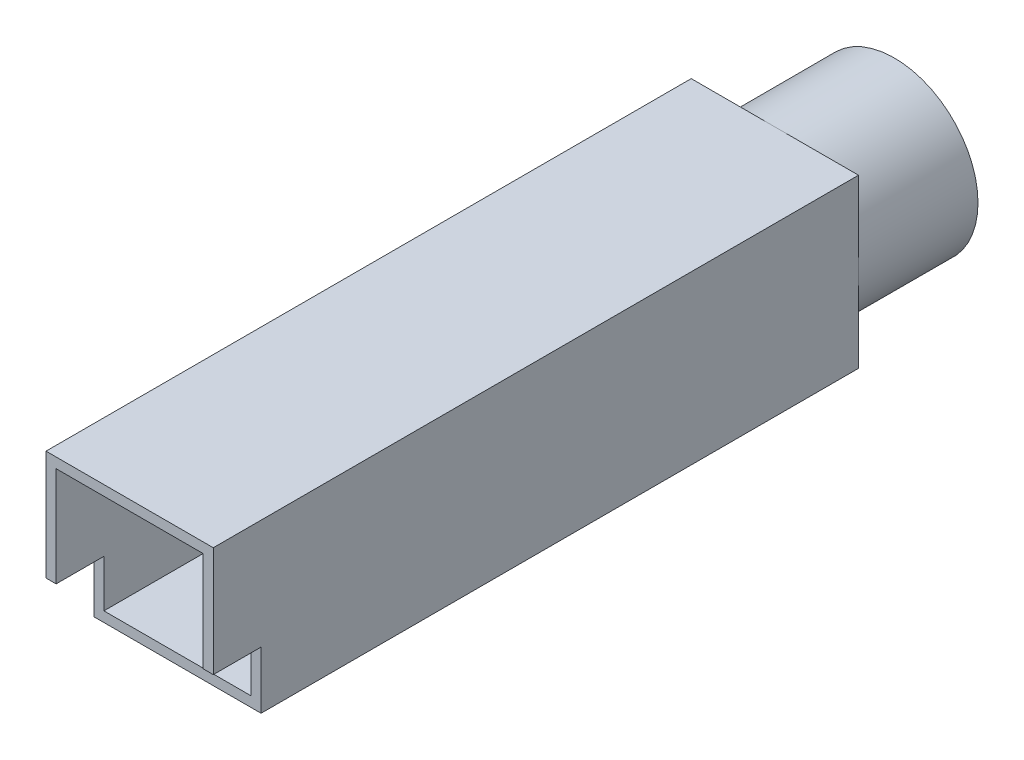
ISO-10303-21;
HEADER;
FILE_DESCRIPTION(('STEP AP214'),'2;1');
FILE_NAME('part.step','',(''),(''),'','','');
FILE_SCHEMA(('AUTOMOTIVE_DESIGN { 1 0 10303 214 1 1 1 1 }'));
ENDSEC;
DATA;
#1=APPLICATION_CONTEXT('core data for automotive mechanical design processes');
#2=APPLICATION_PROTOCOL_DEFINITION('international standard','automotive_design',2000,#1);
#3=PRODUCT_CONTEXT('',#1,'mechanical');
#4=PRODUCT('Part','Part','',(#3));
#5=PRODUCT_RELATED_PRODUCT_CATEGORY('part','',(#4));
#6=PRODUCT_DEFINITION_FORMATION('','',#4);
#7=PRODUCT_DEFINITION_CONTEXT('part definition',#1,'design');
#8=PRODUCT_DEFINITION('design','',#6,#7);
#9=PRODUCT_DEFINITION_SHAPE('','',#8);
#10=(LENGTH_UNIT() NAMED_UNIT(*) SI_UNIT(.MILLI.,.METRE.));
#11=(NAMED_UNIT(*) PLANE_ANGLE_UNIT() SI_UNIT($,.RADIAN.));
#12=(NAMED_UNIT(*) SI_UNIT($,.STERADIAN.) SOLID_ANGLE_UNIT());
#13=UNCERTAINTY_MEASURE_WITH_UNIT(LENGTH_MEASURE(1.E-05),#10,'distance_accuracy_value','');
#14=(GEOMETRIC_REPRESENTATION_CONTEXT(3) GLOBAL_UNCERTAINTY_ASSIGNED_CONTEXT((#13)) GLOBAL_UNIT_ASSIGNED_CONTEXT((#10,
#11,#12)) REPRESENTATION_CONTEXT('',''));
#15=CARTESIAN_POINT('',(0.,0.,0.));
#16=DIRECTION('',(0.,0.,1.));
#17=DIRECTION('',(1.,0.,0.));
#18=AXIS2_PLACEMENT_3D('',#15,#16,#17);
#19=CARTESIAN_POINT('',(15.3825358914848,-15.3825358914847,160.));
#20=DIRECTION('',(-1.,0.,0.));
#21=DIRECTION('',(0.,0.,1.));
#22=AXIS2_PLACEMENT_3D('',#19,#20,#21);
#23=PLANE('',#22);
#24=DIRECTION('',(0.,-1.,0.));
#25=VECTOR('',#24,1.);
#26=CARTESIAN_POINT('',(15.3825358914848,-15.3825358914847,150.));
#27=LINE('',#26,#25);
#28=CARTESIAN_POINT('',(15.3825358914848,-5.5,150.));
#29=VERTEX_POINT('',#28);
#30=CARTESIAN_POINT('',(15.3825358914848,-15.3825358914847,150.));
#31=VERTEX_POINT('',#30);
#32=EDGE_CURVE('E499',#29,#31,#27,.T.);
#33=ORIENTED_EDGE('',*,*,#32,.F.);
#34=DIRECTION('',(0.,0.,-1.));
#35=VECTOR('',#34,1.);
#36=CARTESIAN_POINT('',(15.3825358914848,-5.5,160.));
#37=LINE('',#36,#35);
#38=CARTESIAN_POINT('',(15.3825358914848,-5.5,160.));
#39=VERTEX_POINT('',#38);
#40=EDGE_CURVE('E503',#39,#29,#37,.T.);
#41=ORIENTED_EDGE('',*,*,#40,.F.);
#42=DIRECTION('',(0.,1.,0.));
#43=VECTOR('',#42,1.);
#44=CARTESIAN_POINT('',(15.3825358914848,-15.3825358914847,160.));
#45=LINE('',#44,#43);
#46=CARTESIAN_POINT('',(15.3825358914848,15.3825358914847,160.));
#47=VERTEX_POINT('',#46);
#48=EDGE_CURVE('E188',#39,#47,#45,.T.);
#49=ORIENTED_EDGE('',*,*,#48,.T.);
#50=DIRECTION('',(0.,0.,-1.));
#51=VECTOR('',#50,1.);
#52=CARTESIAN_POINT('',(15.3825358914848,15.3825358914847,160.));
#53=LINE('',#52,#51);
#54=CARTESIAN_POINT('',(15.3825358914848,15.3825358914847,26.));
#55=VERTEX_POINT('',#54);
#56=EDGE_CURVE('E204',#47,#55,#53,.T.);
#57=ORIENTED_EDGE('',*,*,#56,.T.);
#58=DIRECTION('',(0.,1.,0.));
#59=VECTOR('',#58,1.);
#60=CARTESIAN_POINT('',(15.3825358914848,-15.3825358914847,26.));
#61=LINE('',#60,#59);
#62=CARTESIAN_POINT('',(15.3825358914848,-15.3825358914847,26.));
#63=VERTEX_POINT('',#62);
#64=EDGE_CURVE('E536',#63,#55,#61,.T.);
#65=ORIENTED_EDGE('',*,*,#64,.F.);
#66=DIRECTION('',(0.,0.,-1.));
#67=VECTOR('',#66,1.);
#68=CARTESIAN_POINT('',(15.3825358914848,-15.3825358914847,160.));
#69=LINE('',#68,#67);
#70=EDGE_CURVE('E551',#31,#63,#69,.T.);
#71=ORIENTED_EDGE('',*,*,#70,.F.);
#72=EDGE_LOOP('',(#33,#41,#49,#57,#65,#71));
#73=FACE_BOUND('',#72,.T.);
#74=ADVANCED_FACE('F39',(#73),#23,.T.);
#75=CARTESIAN_POINT('',(-15.3825358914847,15.3825358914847,160.));
#76=DIRECTION('',(0.,-1.,0.));
#77=DIRECTION('',(0.,0.,-1.));
#78=AXIS2_PLACEMENT_3D('',#75,#76,#77);
#79=PLANE('',#78);
#80=DIRECTION('',(0.,0.,-1.));
#81=VECTOR('',#80,1.);
#82=CARTESIAN_POINT('',(-15.3825358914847,15.3825358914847,160.));
#83=LINE('',#82,#81);
#84=CARTESIAN_POINT('',(-15.3825358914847,15.3825358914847,160.));
#85=VERTEX_POINT('',#84);
#86=CARTESIAN_POINT('',(-15.3825358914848,15.3825358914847,26.));
#87=VERTEX_POINT('',#86);
#88=EDGE_CURVE('E553',#85,#87,#83,.T.);
#89=ORIENTED_EDGE('',*,*,#88,.T.);
#90=DIRECTION('',(-1.,0.,0.));
#91=VECTOR('',#90,1.);
#92=CARTESIAN_POINT('',(-15.3825358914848,15.3825358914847,26.));
#93=LINE('',#92,#91);
#94=EDGE_CURVE('E538',#55,#87,#93,.T.);
#95=ORIENTED_EDGE('',*,*,#94,.F.);
#96=ORIENTED_EDGE('',*,*,#56,.F.);
#97=DIRECTION('',(-1.,0.,0.));
#98=VECTOR('',#97,1.);
#99=CARTESIAN_POINT('',(-15.3825358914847,15.3825358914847,160.));
#100=LINE('',#99,#98);
#101=EDGE_CURVE('E546',#47,#85,#100,.T.);
#102=ORIENTED_EDGE('',*,*,#101,.T.);
#103=EDGE_LOOP('',(#89,#95,#96,#102));
#104=FACE_BOUND('',#103,.T.);
#105=ADVANCED_FACE('F253',(#104),#79,.T.);
#106=CARTESIAN_POINT('',(-15.3825358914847,-15.3825358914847,160.));
#107=DIRECTION('',(1.,0.,0.));
#108=DIRECTION('',(0.,0.,-1.));
#109=AXIS2_PLACEMENT_3D('',#106,#107,#108);
#110=PLANE('',#109);
#111=DIRECTION('',(0.,1.,0.));
#112=VECTOR('',#111,1.);
#113=CARTESIAN_POINT('',(-15.3825358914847,-15.3825358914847,150.));
#114=LINE('',#113,#112);
#115=CARTESIAN_POINT('',(-15.3825358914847,-15.3825358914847,150.));
#116=VERTEX_POINT('',#115);
#117=CARTESIAN_POINT('',(-15.3825358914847,-5.5,150.));
#118=VERTEX_POINT('',#117);
#119=EDGE_CURVE('E497',#116,#118,#114,.T.);
#120=ORIENTED_EDGE('',*,*,#119,.F.);
#121=DIRECTION('',(0.,0.,-1.));
#122=VECTOR('',#121,1.);
#123=CARTESIAN_POINT('',(-15.3825358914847,-15.3825358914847,160.));
#124=LINE('',#123,#122);
#125=CARTESIAN_POINT('',(-15.3825358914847,-15.3825358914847,26.));
#126=VERTEX_POINT('',#125);
#127=EDGE_CURVE('E64',#116,#126,#124,.T.);
#128=ORIENTED_EDGE('',*,*,#127,.T.);
#129=DIRECTION('',(0.,-1.,0.));
#130=VECTOR('',#129,1.);
#131=CARTESIAN_POINT('',(-15.3825358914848,-15.3825358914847,26.));
#132=LINE('',#131,#130);
#133=EDGE_CURVE('E540',#87,#126,#132,.T.);
#134=ORIENTED_EDGE('',*,*,#133,.F.);
#135=ORIENTED_EDGE('',*,*,#88,.F.);
#136=DIRECTION('',(0.,-1.,0.));
#137=VECTOR('',#136,1.);
#138=CARTESIAN_POINT('',(-15.3825358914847,-15.3825358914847,160.));
#139=LINE('',#138,#137);
#140=CARTESIAN_POINT('',(-15.3825358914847,-5.5,160.));
#141=VERTEX_POINT('',#140);
#142=EDGE_CURVE('E548',#85,#141,#139,.T.);
#143=ORIENTED_EDGE('',*,*,#142,.T.);
#144=DIRECTION('',(0.,0.,1.));
#145=VECTOR('',#144,1.);
#146=CARTESIAN_POINT('',(-15.3825358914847,-5.5,160.));
#147=LINE('',#146,#145);
#148=EDGE_CURVE('E501',#118,#141,#147,.T.);
#149=ORIENTED_EDGE('',*,*,#148,.F.);
#150=EDGE_LOOP('',(#120,#128,#134,#135,#143,#149));
#151=FACE_BOUND('',#150,.T.);
#152=ADVANCED_FACE('F261',(#151),#110,.T.);
#153=CARTESIAN_POINT('',(-15.3825358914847,-15.3825358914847,160.));
#154=DIRECTION('',(0.,1.,0.));
#155=DIRECTION('',(0.,0.,1.));
#156=AXIS2_PLACEMENT_3D('',#153,#154,#155);
#157=PLANE('',#156);
#158=DIRECTION('',(-1.,0.,0.));
#159=VECTOR('',#158,1.);
#160=CARTESIAN_POINT('',(-15.3825358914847,-15.3825358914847,150.));
#161=LINE('',#160,#159);
#162=EDGE_CURVE('E490',#31,#116,#161,.T.);
#163=ORIENTED_EDGE('',*,*,#162,.F.);
#164=ORIENTED_EDGE('',*,*,#70,.T.);
#165=DIRECTION('',(1.,0.,0.));
#166=VECTOR('',#165,1.);
#167=CARTESIAN_POINT('',(-15.3825358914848,-15.3825358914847,26.));
#168=LINE('',#167,#166);
#169=EDGE_CURVE('E542',#126,#63,#168,.T.);
#170=ORIENTED_EDGE('',*,*,#169,.F.);
#171=ORIENTED_EDGE('',*,*,#127,.F.);
#172=EDGE_LOOP('',(#163,#164,#170,#171));
#173=FACE_BOUND('',#172,.T.);
#174=ADVANCED_FACE('F391',(#173),#157,.T.);
#175=CARTESIAN_POINT('',(0.,0.,0.));
#176=DIRECTION('',(0.,0.,1.));
#177=DIRECTION('',(1.,0.,0.));
#178=AXIS2_PLACEMENT_3D('',#175,#176,#177);
#179=PLANE('',#178);
#180=CARTESIAN_POINT('',(0.,0.,0.));
#181=DIRECTION('',(0.,0.,1.));
#182=DIRECTION('',(1.,0.,0.));
#183=AXIS2_PLACEMENT_3D('',#180,#181,#182);
#184=CIRCLE('',#183,17.5);
#185=CARTESIAN_POINT('',(17.5,0.,0.));
#186=VERTEX_POINT('',#185);
#187=EDGE_CURVE('E43',#186,#186,#184,.T.);
#188=ORIENTED_EDGE('',*,*,#187,.F.);
#189=EDGE_LOOP('',(#188));
#190=FACE_BOUND('',#189,.T.);
#191=CARTESIAN_POINT('',(0.,0.,0.));
#192=DIRECTION('',(0.,0.,1.));
#193=DIRECTION('',(1.,0.,0.));
#194=AXIS2_PLACEMENT_3D('',#191,#192,#193);
#195=CIRCLE('',#194,16.);
#196=CARTESIAN_POINT('',(16.,0.,0.));
#197=VERTEX_POINT('',#196);
#198=EDGE_CURVE('E228',#197,#197,#195,.T.);
#199=ORIENTED_EDGE('',*,*,#198,.T.);
#200=EDGE_LOOP('',(#199));
#201=FACE_BOUND('',#200,.T.);
#202=ADVANCED_FACE('F235',(#190,#201),#179,.F.);
#203=CARTESIAN_POINT('',(0.,0.,25.));
#204=DIRECTION('',(0.,0.,-1.));
#205=DIRECTION('',(-1.,0.,0.));
#206=AXIS2_PLACEMENT_3D('',#203,#204,#205);
#207=CYLINDRICAL_SURFACE('',#206,17.5);
#208=CARTESIAN_POINT('',(0.,0.,25.));
#209=DIRECTION('',(0.,0.,1.));
#210=DIRECTION('',(1.,0.,0.));
#211=AXIS2_PLACEMENT_3D('',#208,#209,#210);
#212=CIRCLE('',#211,17.5);
#213=CARTESIAN_POINT('',(17.5,0.,25.));
#214=VERTEX_POINT('',#213);
#215=CARTESIAN_POINT('',(0.,17.5,25.));
#216=VERTEX_POINT('',#215);
#217=EDGE_CURVE('E11',#214,#216,#212,.T.);
#218=ORIENTED_EDGE('',*,*,#217,.F.);
#219=CARTESIAN_POINT('',(0.,-17.5,25.));
#220=VERTEX_POINT('',#219);
#221=EDGE_CURVE('E49',#220,#214,#212,.T.);
#222=ORIENTED_EDGE('',*,*,#221,.F.);
#223=CARTESIAN_POINT('',(-17.5,0.,25.));
#224=VERTEX_POINT('',#223);
#225=EDGE_CURVE('E467',#224,#220,#212,.T.);
#226=ORIENTED_EDGE('',*,*,#225,.F.);
#227=EDGE_CURVE('E48',#216,#224,#212,.T.);
#228=ORIENTED_EDGE('',*,*,#227,.F.);
#229=EDGE_LOOP('',(#218,#222,#226,#228));
#230=FACE_BOUND('',#229,.T.);
#231=ORIENTED_EDGE('',*,*,#187,.T.);
#232=EDGE_LOOP('',(#231));
#233=FACE_BOUND('',#232,.T.);
#234=ADVANCED_FACE('F41',(#230,#233),#207,.T.);
#235=CARTESIAN_POINT('',(0.,0.,25.));
#236=DIRECTION('',(0.,0.,-1.));
#237=DIRECTION('',(-1.,0.,0.));
#238=AXIS2_PLACEMENT_3D('',#235,#236,#237);
#239=CYLINDRICAL_SURFACE('',#238,16.);
#240=CARTESIAN_POINT('',(0.,0.,25.));
#241=DIRECTION('',(0.,0.,1.));
#242=DIRECTION('',(1.,0.,0.));
#243=AXIS2_PLACEMENT_3D('',#240,#241,#242);
#244=CIRCLE('',#243,16.);
#245=CARTESIAN_POINT('',(16.,0.,25.));
#246=VERTEX_POINT('',#245);
#247=EDGE_CURVE('E229',#246,#246,#244,.T.);
#248=ORIENTED_EDGE('',*,*,#247,.T.);
#249=EDGE_LOOP('',(#248));
#250=FACE_BOUND('',#249,.T.);
#251=ORIENTED_EDGE('',*,*,#198,.F.);
#252=EDGE_LOOP('',(#251));
#253=FACE_BOUND('',#252,.T.);
#254=ADVANCED_FACE('F237',(#250,#253),#239,.F.);
#255=CARTESIAN_POINT('',(0.,0.,25.));
#256=DIRECTION('',(0.,0.,-1.));
#257=DIRECTION('',(-1.,0.,0.));
#258=AXIS2_PLACEMENT_3D('',#255,#256,#257);
#259=PLANE('',#258);
#260=ORIENTED_EDGE('',*,*,#217,.T.);
#261=DIRECTION('',(-1.,0.,0.));
#262=VECTOR('',#261,1.);
#263=CARTESIAN_POINT('',(-17.5,17.5,25.));
#264=LINE('',#263,#262);
#265=CARTESIAN_POINT('',(17.5,17.5,25.));
#266=VERTEX_POINT('',#265);
#267=EDGE_CURVE('E214',#266,#216,#264,.T.);
#268=ORIENTED_EDGE('',*,*,#267,.F.);
#269=DIRECTION('',(0.,1.,0.));
#270=VECTOR('',#269,1.);
#271=CARTESIAN_POINT('',(17.5,-17.5,25.));
#272=LINE('',#271,#270);
#273=EDGE_CURVE('E213',#214,#266,#272,.T.);
#274=ORIENTED_EDGE('',*,*,#273,.F.);
#275=EDGE_LOOP('',(#260,#268,#274));
#276=FACE_BOUND('',#275,.T.);
#277=ADVANCED_FACE('F239',(#276),#259,.T.);
#278=CARTESIAN_POINT('',(-17.5,17.5,25.));
#279=VERTEX_POINT('',#278);
#280=EDGE_CURVE('E212',#216,#279,#264,.T.);
#281=ORIENTED_EDGE('',*,*,#280,.F.);
#282=ORIENTED_EDGE('',*,*,#227,.T.);
#283=DIRECTION('',(0.,-1.,0.));
#284=VECTOR('',#283,1.);
#285=CARTESIAN_POINT('',(-17.5,-17.5,25.));
#286=LINE('',#285,#284);
#287=EDGE_CURVE('E218',#279,#224,#286,.T.);
#288=ORIENTED_EDGE('',*,*,#287,.F.);
#289=EDGE_LOOP('',(#281,#282,#288));
#290=FACE_BOUND('',#289,.T.);
#291=ADVANCED_FACE('F246',(#290),#259,.T.);
#292=CARTESIAN_POINT('',(-17.5,-17.5,25.));
#293=VERTEX_POINT('',#292);
#294=EDGE_CURVE('E217',#224,#293,#286,.T.);
#295=ORIENTED_EDGE('',*,*,#294,.F.);
#296=ORIENTED_EDGE('',*,*,#225,.T.);
#297=DIRECTION('',(1.,0.,0.));
#298=VECTOR('',#297,1.);
#299=CARTESIAN_POINT('',(-17.5,-17.5,25.));
#300=LINE('',#299,#298);
#301=EDGE_CURVE('E196',#293,#220,#300,.T.);
#302=ORIENTED_EDGE('',*,*,#301,.F.);
#303=EDGE_LOOP('',(#295,#296,#302));
#304=FACE_BOUND('',#303,.T.);
#305=ADVANCED_FACE('F421',(#304),#259,.T.);
#306=ORIENTED_EDGE('',*,*,#247,.F.);
#307=EDGE_LOOP('',(#306));
#308=FACE_BOUND('',#307,.T.);
#309=DIRECTION('',(1.,0.,0.));
#310=VECTOR('',#309,1.);
#311=CARTESIAN_POINT('',(-8.64838937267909,-8.6483893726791,25.));
#312=LINE('',#311,#310);
#313=CARTESIAN_POINT('',(-8.64838937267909,-8.6483893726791,25.));
#314=VERTEX_POINT('',#313);
#315=CARTESIAN_POINT('',(8.64838937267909,-8.6483893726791,25.));
#316=VERTEX_POINT('',#315);
#317=EDGE_CURVE('E509',#314,#316,#312,.T.);
#318=ORIENTED_EDGE('',*,*,#317,.T.);
#319=DIRECTION('',(0.,1.,0.));
#320=VECTOR('',#319,1.);
#321=CARTESIAN_POINT('',(8.64838937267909,-8.6483893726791,25.));
#322=LINE('',#321,#320);
#323=CARTESIAN_POINT('',(8.64838937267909,8.64838937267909,25.));
#324=VERTEX_POINT('',#323);
#325=EDGE_CURVE('E505',#316,#324,#322,.T.);
#326=ORIENTED_EDGE('',*,*,#325,.T.);
#327=DIRECTION('',(-1.,0.,0.));
#328=VECTOR('',#327,1.);
#329=CARTESIAN_POINT('',(-8.64838937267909,8.64838937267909,25.));
#330=LINE('',#329,#328);
#331=CARTESIAN_POINT('',(-8.64838937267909,8.64838937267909,25.));
#332=VERTEX_POINT('',#331);
#333=EDGE_CURVE('E519',#324,#332,#330,.T.);
#334=ORIENTED_EDGE('',*,*,#333,.T.);
#335=DIRECTION('',(0.,-1.,0.));
#336=VECTOR('',#335,1.);
#337=CARTESIAN_POINT('',(-8.64838937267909,-8.6483893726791,25.));
#338=LINE('',#337,#336);
#339=EDGE_CURVE('E522',#332,#314,#338,.T.);
#340=ORIENTED_EDGE('',*,*,#339,.T.);
#341=EDGE_LOOP('',(#318,#326,#334,#340));
#342=FACE_BOUND('',#341,.T.);
#343=ADVANCED_FACE('F268',(#308,#342),#259,.T.);
#344=CARTESIAN_POINT('',(0.,0.,160.));
#345=DIRECTION('',(0.,0.,-1.));
#346=DIRECTION('',(-1.,0.,0.));
#347=AXIS2_PLACEMENT_3D('',#344,#345,#346);
#348=PLANE('',#347);
#349=DIRECTION('',(0.,-1.,0.));
#350=VECTOR('',#349,1.);
#351=CARTESIAN_POINT('',(-17.5,-17.5,160.));
#352=LINE('',#351,#350);
#353=CARTESIAN_POINT('',(-17.5,17.5,160.));
#354=VERTEX_POINT('',#353);
#355=CARTESIAN_POINT('',(-17.5,-5.5,160.));
#356=VERTEX_POINT('',#355);
#357=EDGE_CURVE('E198',#354,#356,#352,.T.);
#358=ORIENTED_EDGE('',*,*,#357,.T.);
#359=DIRECTION('',(-1.,0.,0.));
#360=VECTOR('',#359,1.);
#361=CARTESIAN_POINT('',(-17.5,-5.5,160.));
#362=LINE('',#361,#360);
#363=EDGE_CURVE('E178',#141,#356,#362,.T.);
#364=ORIENTED_EDGE('',*,*,#363,.F.);
#365=ORIENTED_EDGE('',*,*,#142,.F.);
#366=ORIENTED_EDGE('',*,*,#101,.F.);
#367=ORIENTED_EDGE('',*,*,#48,.F.);
#368=CARTESIAN_POINT('',(17.5,-5.5,160.));
#369=VERTEX_POINT('',#368);
#370=EDGE_CURVE('E170',#369,#39,#362,.T.);
#371=ORIENTED_EDGE('',*,*,#370,.F.);
#372=DIRECTION('',(0.,1.,0.));
#373=VECTOR('',#372,1.);
#374=CARTESIAN_POINT('',(17.5,-17.5,160.));
#375=LINE('',#374,#373);
#376=CARTESIAN_POINT('',(17.5,17.5,160.));
#377=VERTEX_POINT('',#376);
#378=EDGE_CURVE('E185',#369,#377,#375,.T.);
#379=ORIENTED_EDGE('',*,*,#378,.T.);
#380=DIRECTION('',(-1.,0.,0.));
#381=VECTOR('',#380,1.);
#382=CARTESIAN_POINT('',(-17.5,17.5,160.));
#383=LINE('',#382,#381);
#384=EDGE_CURVE('E195',#377,#354,#383,.T.);
#385=ORIENTED_EDGE('',*,*,#384,.T.);
#386=EDGE_LOOP('',(#358,#364,#365,#366,#367,#371,#379,#385));
#387=FACE_BOUND('',#386,.T.);
#388=ADVANCED_FACE('F184',(#387),#348,.F.);
#389=ORIENTED_EDGE('',*,*,#221,.T.);
#390=CARTESIAN_POINT('',(17.5,-17.5,25.));
#391=VERTEX_POINT('',#390);
#392=EDGE_CURVE('E209',#391,#214,#272,.T.);
#393=ORIENTED_EDGE('',*,*,#392,.F.);
#394=EDGE_CURVE('E201',#220,#391,#300,.T.);
#395=ORIENTED_EDGE('',*,*,#394,.F.);
#396=EDGE_LOOP('',(#389,#393,#395));
#397=FACE_BOUND('',#396,.T.);
#398=ADVANCED_FACE('F249',(#397),#259,.T.);
#399=CARTESIAN_POINT('',(17.5,-17.5,160.));
#400=DIRECTION('',(-1.,0.,0.));
#401=DIRECTION('',(0.,0.,1.));
#402=AXIS2_PLACEMENT_3D('',#399,#400,#401);
#403=PLANE('',#402);
#404=DIRECTION('',(0.,0.,1.));
#405=VECTOR('',#404,1.);
#406=CARTESIAN_POINT('',(17.5,-5.5,150.));
#407=LINE('',#406,#405);
#408=CARTESIAN_POINT('',(17.5,-5.5,150.));
#409=VERTEX_POINT('',#408);
#410=EDGE_CURVE('E167',#409,#369,#407,.T.);
#411=ORIENTED_EDGE('',*,*,#410,.F.);
#412=DIRECTION('',(0.,-1.,0.));
#413=VECTOR('',#412,1.);
#414=CARTESIAN_POINT('',(17.5,-5.5,150.));
#415=LINE('',#414,#413);
#416=CARTESIAN_POINT('',(17.5,-17.5,150.));
#417=VERTEX_POINT('',#416);
#418=EDGE_CURVE('E487',#409,#417,#415,.T.);
#419=ORIENTED_EDGE('',*,*,#418,.T.);
#420=DIRECTION('',(0.,0.,-1.));
#421=VECTOR('',#420,1.);
#422=CARTESIAN_POINT('',(17.5,-17.5,160.));
#423=LINE('',#422,#421);
#424=EDGE_CURVE('E208',#417,#391,#423,.T.);
#425=ORIENTED_EDGE('',*,*,#424,.T.);
#426=ORIENTED_EDGE('',*,*,#392,.T.);
#427=ORIENTED_EDGE('',*,*,#273,.T.);
#428=DIRECTION('',(0.,0.,-1.));
#429=VECTOR('',#428,1.);
#430=CARTESIAN_POINT('',(17.5,17.5,160.));
#431=LINE('',#430,#429);
#432=EDGE_CURVE('E194',#377,#266,#431,.T.);
#433=ORIENTED_EDGE('',*,*,#432,.F.);
#434=ORIENTED_EDGE('',*,*,#378,.F.);
#435=EDGE_LOOP('',(#411,#419,#425,#426,#427,#433,#434));
#436=FACE_BOUND('',#435,.T.);
#437=ADVANCED_FACE('F192',(#436),#403,.F.);
#438=CARTESIAN_POINT('',(-17.5,17.5,160.));
#439=DIRECTION('',(0.,-1.,0.));
#440=DIRECTION('',(0.,0.,-1.));
#441=AXIS2_PLACEMENT_3D('',#438,#439,#440);
#442=PLANE('',#441);
#443=ORIENTED_EDGE('',*,*,#267,.T.);
#444=ORIENTED_EDGE('',*,*,#280,.T.);
#445=DIRECTION('',(0.,0.,-1.));
#446=VECTOR('',#445,1.);
#447=CARTESIAN_POINT('',(-17.5,17.5,160.));
#448=LINE('',#447,#446);
#449=EDGE_CURVE('E224',#354,#279,#448,.T.);
#450=ORIENTED_EDGE('',*,*,#449,.F.);
#451=ORIENTED_EDGE('',*,*,#384,.F.);
#452=ORIENTED_EDGE('',*,*,#432,.T.);
#453=EDGE_LOOP('',(#443,#444,#450,#451,#452));
#454=FACE_BOUND('',#453,.T.);
#455=ADVANCED_FACE('F280',(#454),#442,.F.);
#456=CARTESIAN_POINT('',(-17.5,-17.5,160.));
#457=DIRECTION('',(1.,0.,0.));
#458=DIRECTION('',(0.,0.,-1.));
#459=AXIS2_PLACEMENT_3D('',#456,#457,#458);
#460=PLANE('',#459);
#461=DIRECTION('',(0.,0.,-1.));
#462=VECTOR('',#461,1.);
#463=CARTESIAN_POINT('',(-17.5,-17.5,160.));
#464=LINE('',#463,#462);
#465=CARTESIAN_POINT('',(-17.5,-17.5,150.));
#466=VERTEX_POINT('',#465);
#467=EDGE_CURVE('E222',#466,#293,#464,.T.);
#468=ORIENTED_EDGE('',*,*,#467,.F.);
#469=DIRECTION('',(0.,-1.,0.));
#470=VECTOR('',#469,1.);
#471=CARTESIAN_POINT('',(-17.5,-5.5,150.));
#472=LINE('',#471,#470);
#473=CARTESIAN_POINT('',(-17.5,-5.5,150.));
#474=VERTEX_POINT('',#473);
#475=EDGE_CURVE('E56',#474,#466,#472,.T.);
#476=ORIENTED_EDGE('',*,*,#475,.F.);
#477=DIRECTION('',(0.,0.,-1.));
#478=VECTOR('',#477,1.);
#479=CARTESIAN_POINT('',(-17.5,-5.5,150.));
#480=LINE('',#479,#478);
#481=EDGE_CURVE('E189',#356,#474,#480,.T.);
#482=ORIENTED_EDGE('',*,*,#481,.F.);
#483=ORIENTED_EDGE('',*,*,#357,.F.);
#484=ORIENTED_EDGE('',*,*,#449,.T.);
#485=ORIENTED_EDGE('',*,*,#287,.T.);
#486=ORIENTED_EDGE('',*,*,#294,.T.);
#487=EDGE_LOOP('',(#468,#476,#482,#483,#484,#485,#486));
#488=FACE_BOUND('',#487,.T.);
#489=ADVANCED_FACE('F276',(#488),#460,.F.);
#490=CARTESIAN_POINT('',(-17.5,-17.5,160.));
#491=DIRECTION('',(0.,1.,0.));
#492=DIRECTION('',(0.,0.,1.));
#493=AXIS2_PLACEMENT_3D('',#490,#491,#492);
#494=PLANE('',#493);
#495=ORIENTED_EDGE('',*,*,#424,.F.);
#496=DIRECTION('',(1.,0.,0.));
#497=VECTOR('',#496,1.);
#498=CARTESIAN_POINT('',(-17.5,-17.5,150.));
#499=LINE('',#498,#497);
#500=EDGE_CURVE('E179',#466,#417,#499,.T.);
#501=ORIENTED_EDGE('',*,*,#500,.F.);
#502=ORIENTED_EDGE('',*,*,#467,.T.);
#503=ORIENTED_EDGE('',*,*,#301,.T.);
#504=ORIENTED_EDGE('',*,*,#394,.T.);
#505=EDGE_LOOP('',(#495,#501,#502,#503,#504));
#506=FACE_BOUND('',#505,.T.);
#507=ADVANCED_FACE('F272',(#506),#494,.F.);
#508=CARTESIAN_POINT('',(-8.64838937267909,-8.6483893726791,26.));
#509=DIRECTION('',(0.,1.,0.));
#510=DIRECTION('',(0.,0.,1.));
#511=AXIS2_PLACEMENT_3D('',#508,#509,#510);
#512=PLANE('',#511);
#513=ORIENTED_EDGE('',*,*,#317,.F.);
#514=DIRECTION('',(0.,0.,-1.));
#515=VECTOR('',#514,1.);
#516=CARTESIAN_POINT('',(-8.64838937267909,-8.6483893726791,26.));
#517=LINE('',#516,#515);
#518=CARTESIAN_POINT('',(-8.64838937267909,-8.6483893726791,26.));
#519=VERTEX_POINT('',#518);
#520=EDGE_CURVE('E529',#519,#314,#517,.T.);
#521=ORIENTED_EDGE('',*,*,#520,.F.);
#522=DIRECTION('',(1.,0.,0.));
#523=VECTOR('',#522,1.);
#524=CARTESIAN_POINT('',(-8.64838937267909,-8.6483893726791,26.));
#525=LINE('',#524,#523);
#526=CARTESIAN_POINT('',(8.64838937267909,-8.6483893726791,26.));
#527=VERTEX_POINT('',#526);
#528=EDGE_CURVE('E514',#519,#527,#525,.T.);
#529=ORIENTED_EDGE('',*,*,#528,.T.);
#530=DIRECTION('',(0.,0.,-1.));
#531=VECTOR('',#530,1.);
#532=CARTESIAN_POINT('',(8.64838937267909,-8.6483893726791,26.));
#533=LINE('',#532,#531);
#534=EDGE_CURVE('E516',#527,#316,#533,.T.);
#535=ORIENTED_EDGE('',*,*,#534,.T.);
#536=EDGE_LOOP('',(#513,#521,#529,#535));
#537=FACE_BOUND('',#536,.T.);
#538=ADVANCED_FACE('F275',(#537),#512,.T.);
#539=CARTESIAN_POINT('',(-8.64838937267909,-8.6483893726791,26.));
#540=DIRECTION('',(1.,0.,0.));
#541=DIRECTION('',(0.,0.,-1.));
#542=AXIS2_PLACEMENT_3D('',#539,#540,#541);
#543=PLANE('',#542);
#544=ORIENTED_EDGE('',*,*,#339,.F.);
#545=DIRECTION('',(0.,0.,-1.));
#546=VECTOR('',#545,1.);
#547=CARTESIAN_POINT('',(-8.64838937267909,8.64838937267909,26.));
#548=LINE('',#547,#546);
#549=CARTESIAN_POINT('',(-8.64838937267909,8.64838937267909,26.));
#550=VERTEX_POINT('',#549);
#551=EDGE_CURVE('E531',#550,#332,#548,.T.);
#552=ORIENTED_EDGE('',*,*,#551,.F.);
#553=DIRECTION('',(0.,-1.,0.));
#554=VECTOR('',#553,1.);
#555=CARTESIAN_POINT('',(-8.64838937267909,-8.6483893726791,26.));
#556=LINE('',#555,#554);
#557=EDGE_CURVE('E511',#550,#519,#556,.T.);
#558=ORIENTED_EDGE('',*,*,#557,.T.);
#559=ORIENTED_EDGE('',*,*,#520,.T.);
#560=EDGE_LOOP('',(#544,#552,#558,#559));
#561=FACE_BOUND('',#560,.T.);
#562=ADVANCED_FACE('F355',(#561),#543,.T.);
#563=CARTESIAN_POINT('',(-8.64838937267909,8.64838937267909,26.));
#564=DIRECTION('',(0.,-1.,0.));
#565=DIRECTION('',(0.,0.,-1.));
#566=AXIS2_PLACEMENT_3D('',#563,#564,#565);
#567=PLANE('',#566);
#568=ORIENTED_EDGE('',*,*,#333,.F.);
#569=DIRECTION('',(0.,0.,-1.));
#570=VECTOR('',#569,1.);
#571=CARTESIAN_POINT('',(8.64838937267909,8.64838937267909,26.));
#572=LINE('',#571,#570);
#573=CARTESIAN_POINT('',(8.64838937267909,8.64838937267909,26.));
#574=VERTEX_POINT('',#573);
#575=EDGE_CURVE('E533',#574,#324,#572,.T.);
#576=ORIENTED_EDGE('',*,*,#575,.F.);
#577=DIRECTION('',(-1.,0.,0.));
#578=VECTOR('',#577,1.);
#579=CARTESIAN_POINT('',(-8.64838937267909,8.64838937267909,26.));
#580=LINE('',#579,#578);
#581=EDGE_CURVE('E508',#574,#550,#580,.T.);
#582=ORIENTED_EDGE('',*,*,#581,.T.);
#583=ORIENTED_EDGE('',*,*,#551,.T.);
#584=EDGE_LOOP('',(#568,#576,#582,#583));
#585=FACE_BOUND('',#584,.T.);
#586=ADVANCED_FACE('F346',(#585),#567,.T.);
#587=CARTESIAN_POINT('',(8.64838937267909,-8.6483893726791,26.));
#588=DIRECTION('',(-1.,0.,0.));
#589=DIRECTION('',(0.,0.,1.));
#590=AXIS2_PLACEMENT_3D('',#587,#588,#589);
#591=PLANE('',#590);
#592=ORIENTED_EDGE('',*,*,#325,.F.);
#593=ORIENTED_EDGE('',*,*,#534,.F.);
#594=DIRECTION('',(0.,1.,0.));
#595=VECTOR('',#594,1.);
#596=CARTESIAN_POINT('',(8.64838937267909,-8.6483893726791,26.));
#597=LINE('',#596,#595);
#598=EDGE_CURVE('E506',#527,#574,#597,.T.);
#599=ORIENTED_EDGE('',*,*,#598,.T.);
#600=ORIENTED_EDGE('',*,*,#575,.T.);
#601=EDGE_LOOP('',(#592,#593,#599,#600));
#602=FACE_BOUND('',#601,.T.);
#603=ADVANCED_FACE('F337',(#602),#591,.T.);
#604=CARTESIAN_POINT('',(0.,0.,26.));
#605=DIRECTION('',(0.,0.,-1.));
#606=DIRECTION('',(-1.,0.,0.));
#607=AXIS2_PLACEMENT_3D('',#604,#605,#606);
#608=PLANE('',#607);
#609=ORIENTED_EDGE('',*,*,#64,.T.);
#610=ORIENTED_EDGE('',*,*,#94,.T.);
#611=ORIENTED_EDGE('',*,*,#133,.T.);
#612=ORIENTED_EDGE('',*,*,#169,.T.);
#613=EDGE_LOOP('',(#609,#610,#611,#612));
#614=FACE_BOUND('',#613,.T.);
#615=ORIENTED_EDGE('',*,*,#598,.F.);
#616=ORIENTED_EDGE('',*,*,#528,.F.);
#617=ORIENTED_EDGE('',*,*,#557,.F.);
#618=ORIENTED_EDGE('',*,*,#581,.F.);
#619=EDGE_LOOP('',(#615,#616,#617,#618));
#620=FACE_BOUND('',#619,.T.);
#621=ADVANCED_FACE('F311',(#614,#620),#608,.F.);
#622=CARTESIAN_POINT('',(0.,-5.5,0.));
#623=DIRECTION('',(0.,1.,0.));
#624=DIRECTION('',(0.,0.,1.));
#625=AXIS2_PLACEMENT_3D('',#622,#623,#624);
#626=PLANE('',#625);
#627=ORIENTED_EDGE('',*,*,#40,.T.);
#628=DIRECTION('',(1.,0.,0.));
#629=VECTOR('',#628,1.);
#630=CARTESIAN_POINT('',(-17.5,-5.5,150.));
#631=LINE('',#630,#629);
#632=EDGE_CURVE('E173',#29,#409,#631,.T.);
#633=ORIENTED_EDGE('',*,*,#632,.T.);
#634=ORIENTED_EDGE('',*,*,#410,.T.);
#635=ORIENTED_EDGE('',*,*,#370,.T.);
#636=EDGE_LOOP('',(#627,#633,#634,#635));
#637=FACE_BOUND('',#636,.T.);
#638=ADVANCED_FACE('F169',(#637),#626,.F.);
#639=CARTESIAN_POINT('',(-17.5,-5.5,150.));
#640=DIRECTION('',(0.,0.,-1.));
#641=DIRECTION('',(-1.,0.,0.));
#642=AXIS2_PLACEMENT_3D('',#639,#640,#641);
#643=PLANE('',#642);
#644=ORIENTED_EDGE('',*,*,#32,.T.);
#645=ORIENTED_EDGE('',*,*,#162,.T.);
#646=ORIENTED_EDGE('',*,*,#119,.T.);
#647=EDGE_CURVE('E488',#474,#118,#631,.T.);
#648=ORIENTED_EDGE('',*,*,#647,.F.);
#649=ORIENTED_EDGE('',*,*,#475,.T.);
#650=ORIENTED_EDGE('',*,*,#500,.T.);
#651=ORIENTED_EDGE('',*,*,#418,.F.);
#652=ORIENTED_EDGE('',*,*,#632,.F.);
#653=EDGE_LOOP('',(#644,#645,#646,#648,#649,#650,#651,#652));
#654=FACE_BOUND('',#653,.T.);
#655=ADVANCED_FACE('F310',(#654),#643,.F.);
#656=ORIENTED_EDGE('',*,*,#148,.T.);
#657=ORIENTED_EDGE('',*,*,#363,.T.);
#658=ORIENTED_EDGE('',*,*,#481,.T.);
#659=ORIENTED_EDGE('',*,*,#647,.T.);
#660=EDGE_LOOP('',(#656,#657,#658,#659));
#661=FACE_BOUND('',#660,.T.);
#662=ADVANCED_FACE('F313',(#661),#626,.F.);
#663=CLOSED_SHELL('',(#74,#105,#152,#174,#202,#234,#254,#277,#291,#305,#343,#388,#398,#437,#455,
#489,#507,#538,#562,#586,#603,#621,#638,#655,#662));
#664=MANIFOLD_SOLID_BREP('B2',#663);
#665=ADVANCED_BREP_SHAPE_REPRESENTATION('',(#18,#664),#14);
#666=SHAPE_DEFINITION_REPRESENTATION(#9,#665);
ENDSEC;
END-ISO-10303-21;
